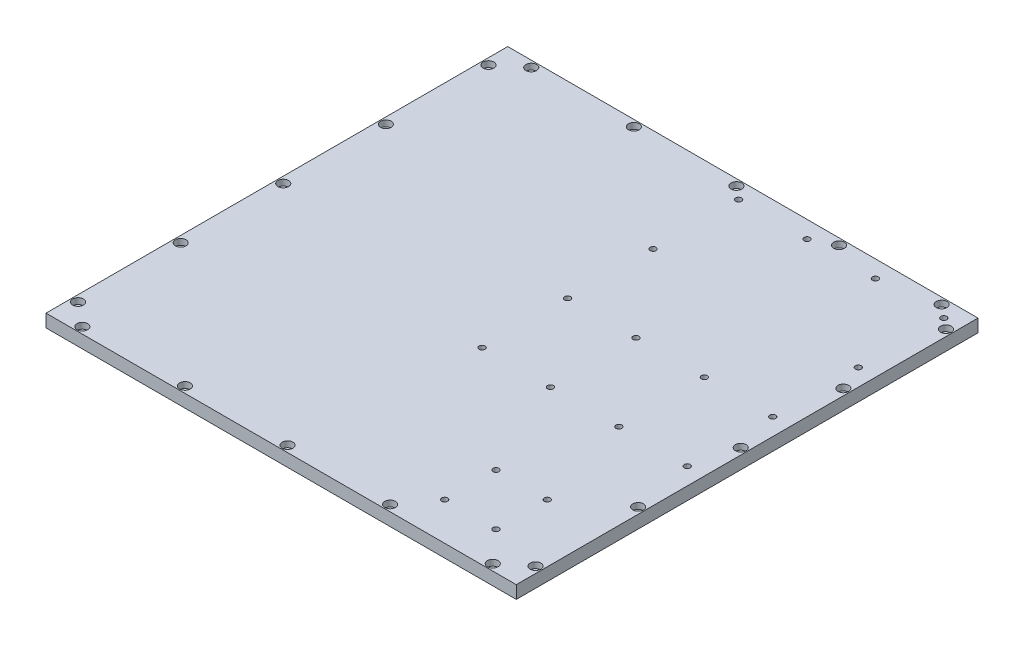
from build123d import *

# Parameters (mm, degrees)
SKETCH1_W                                           = 349.25
SKETCH1_H                                           = 342.9
BOSS_EXTRUDE1_DEPTH                                 = 9.525
CBORE_FOR_8_BINDING_HEAD_MACHINE_SCREW1_D           = 4.3053
CBORE_FOR_8_BINDING_HEAD_MACHINE_SCREW1_CBORE_D     = 7.9375
CBORE_FOR_8_BINDING_HEAD_MACHINE_SCREW1_CBORE_DEPTH = 4.4196
SKETCH5_R                                           = 2.1971
CUT_EXTRUDE1_DEPTH                                  = 245.907571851
SKETCH7_R                                           = 2.1971
CUT_EXTRUDE2_DEPTH                                  = 245.907571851


with BuildPart() as part:
    # Sketch1 → Boss-Extrude1 (new body)
    with BuildSketch(Plane(origin=(0, 0, 0), x_dir=(1, 0, 0), z_dir=(0, 1, 0))):
        Rectangle(SKETCH1_W, SKETCH1_H)
    extrude(amount=BOSS_EXTRUDE1_DEPTH)

    # CBORE for _8 Binding Head Machine Screw1 (through all)
    with Locations(Plane(origin=(0, 9.525, 0), x_dir=(1, 0, 0), z_dir=(0, 1, 0))):
        with Locations((-152.4, 166.6875), (-169.8625, 152.4), (-76.2, 166.6875), (0, 166.6875), (76.2, 166.6875), (152.4, 166.6875), (169.8625, 152.4), (169.8625, 76.2), (169.8625, 0), (169.8625, -76.2), (169.8625, -152.4), (152.4, -166.6875), (76.2, -166.6875), (-152.4, -166.6875), (-76.2, -166.6875), (0, -166.6875), (-169.8625, -152.4), (-169.8625, -76.2), (-169.8625, 0), (-169.8625, 76.2)):
            CounterBoreHole(CBORE_FOR_8_BINDING_HEAD_MACHINE_SCREW1_D / 2, CBORE_FOR_8_BINDING_HEAD_MACHINE_SCREW1_CBORE_D / 2, CBORE_FOR_8_BINDING_HEAD_MACHINE_SCREW1_CBORE_DEPTH)

    # Sketch5 → Cut-Extrude1 (cut, through all)
    with BuildSketch(Plane(origin=(0, 9.525, 0), x_dir=(1, 0, 0), z_dir=(0, 1, 0))):
        with Locations(Location((9.525, 158.75, 0), (0, 0, 270))):
            Circle(SKETCH5_R)
        with Locations(Location((60.325, 158.75, 0), (0, 0, 270))):
            Circle(SKETCH5_R)
        with Locations(Location((111.125, 158.75, 0), (0, 0, 270))):
            Circle(SKETCH5_R)
        with Locations(Location((9.525, 95.25, 0), (0, 0, 270))):
            Circle(SKETCH5_R)
        with Locations(Location((9.525, 31.75, 0), (0, 0, 270))):
            Circle(SKETCH5_R)
        with Locations(Location((161.925, 158.75, 0), (0, 0, 270))):
            Circle(SKETCH5_R)
        with Locations(Location((60.325, 31.75, 0), (0, 0, 270))):
            Circle(SKETCH5_R)
        with Locations(Location((111.125, 31.75, 0), (0, 0, 270))):
            Circle(SKETCH5_R)
        with Locations(Location((161.925, 31.75, 0), (0, 0, 270))):
            Circle(SKETCH5_R)
        with Locations(Location((9.525, -31.75, 0), (0, 0, 270))):
            Circle(SKETCH5_R)
        with Locations(Location((60.325, -31.75, 0), (0, 0, 270))):
            Circle(SKETCH5_R)
        with Locations(Location((111.125, -31.75, 0), (0, 0, 270))):
            Circle(SKETCH5_R)
        with Locations(Location((161.925, -31.75, 0), (0, 0, 270))):
            Circle(SKETCH5_R)
        with Locations(Location((161.925, 95.25, 0), (0, 0, 270))):
            Circle(SKETCH5_R)
    extrude(amount=-CUT_EXTRUDE1_DEPTH, mode=Mode.SUBTRACT)

    # Sketch7 → Cut-Extrude2 (cut, through all)
    with BuildSketch(Plane(origin=(0, 9.525, 0), x_dir=(1, 0, 0), z_dir=(0, 1, 0))):
        with Locations(Location((93.353010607, -143.372057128, 0), (0, 0, 270))):
            Circle(SKETCH7_R)
        with Locations(Location((131.453010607, -143.372057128, 0), (0, 0, 270))):
            Circle(SKETCH7_R)
        with Locations(Location((93.353010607, -105.272057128, 0), (0, 0, 270))):
            Circle(SKETCH7_R)
        with Locations(Location((131.453010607, -105.272057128, 0), (0, 0, 270))):
            Circle(SKETCH7_R)
    extrude(amount=-CUT_EXTRUDE2_DEPTH, mode=Mode.SUBTRACT)


solid = part.part
